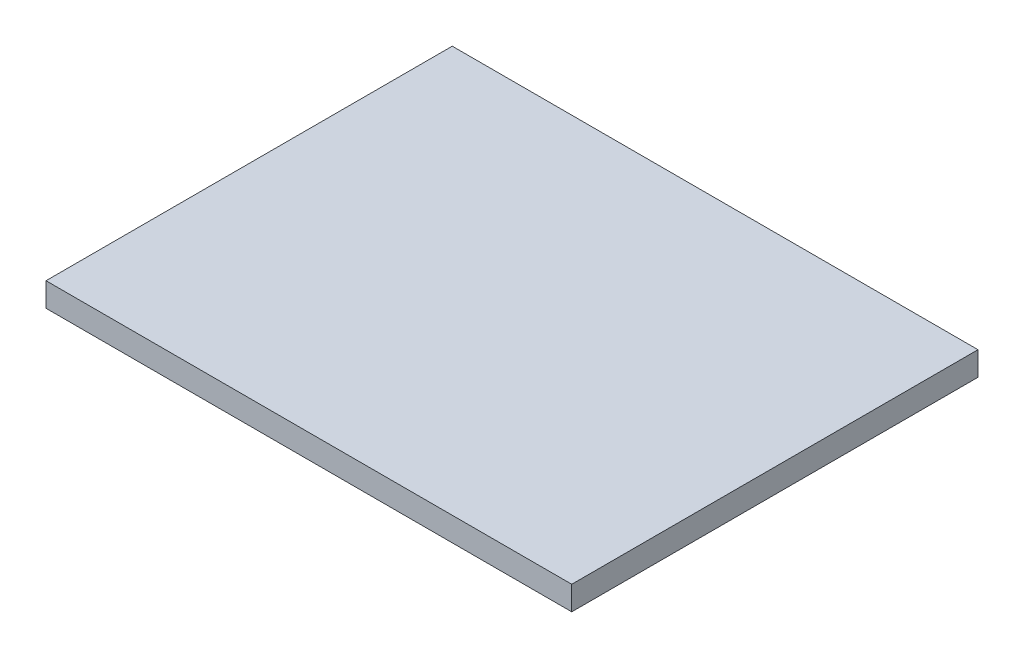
ISO-10303-21;
HEADER;
FILE_DESCRIPTION(('STEP AP214'),'2;1');
FILE_NAME('part.step','',(''),(''),'','','');
FILE_SCHEMA(('AUTOMOTIVE_DESIGN { 1 0 10303 214 1 1 1 1 }'));
ENDSEC;
DATA;
#1=APPLICATION_CONTEXT('core data for automotive mechanical design processes');
#2=APPLICATION_PROTOCOL_DEFINITION('international standard','automotive_design',2000,#1);
#3=PRODUCT_CONTEXT('',#1,'mechanical');
#4=PRODUCT('Part','Part','',(#3));
#5=PRODUCT_RELATED_PRODUCT_CATEGORY('part','',(#4));
#6=PRODUCT_DEFINITION_FORMATION('','',#4);
#7=PRODUCT_DEFINITION_CONTEXT('part definition',#1,'design');
#8=PRODUCT_DEFINITION('design','',#6,#7);
#9=PRODUCT_DEFINITION_SHAPE('','',#8);
#10=(LENGTH_UNIT() NAMED_UNIT(*) SI_UNIT(.MILLI.,.METRE.));
#11=(NAMED_UNIT(*) PLANE_ANGLE_UNIT() SI_UNIT($,.RADIAN.));
#12=(NAMED_UNIT(*) SI_UNIT($,.STERADIAN.) SOLID_ANGLE_UNIT());
#13=UNCERTAINTY_MEASURE_WITH_UNIT(LENGTH_MEASURE(1.E-05),#10,'distance_accuracy_value','');
#14=(GEOMETRIC_REPRESENTATION_CONTEXT(3) GLOBAL_UNCERTAINTY_ASSIGNED_CONTEXT((#13)) GLOBAL_UNIT_ASSIGNED_CONTEXT((#10,
#11,#12)) REPRESENTATION_CONTEXT('',''));
#15=CARTESIAN_POINT('',(0.,0.,0.));
#16=DIRECTION('',(0.,0.,1.));
#17=DIRECTION('',(1.,0.,0.));
#18=AXIS2_PLACEMENT_3D('',#15,#16,#17);
#19=CARTESIAN_POINT('',(0.,5.,0.));
#20=DIRECTION('',(1.,0.,0.));
#21=DIRECTION('',(0.,0.,-1.));
#22=AXIS2_PLACEMENT_3D('',#19,#20,#21);
#23=PLANE('',#22);
#24=DIRECTION('',(0.,0.,1.));
#25=VECTOR('',#24,1.);
#26=CARTESIAN_POINT('',(0.,0.,0.));
#27=LINE('',#26,#25);
#28=CARTESIAN_POINT('',(0.,0.,-85.));
#29=VERTEX_POINT('',#28);
#30=CARTESIAN_POINT('',(0.,0.,0.));
#31=VERTEX_POINT('',#30);
#32=EDGE_CURVE('E94',#29,#31,#27,.T.);
#33=ORIENTED_EDGE('',*,*,#32,.T.);
#34=DIRECTION('',(0.,-1.,0.));
#35=VECTOR('',#34,1.);
#36=CARTESIAN_POINT('',(0.,5.,0.));
#37=LINE('',#36,#35);
#38=CARTESIAN_POINT('',(0.,5.,0.));
#39=VERTEX_POINT('',#38);
#40=EDGE_CURVE('E11',#39,#31,#37,.T.);
#41=ORIENTED_EDGE('',*,*,#40,.F.);
#42=DIRECTION('',(0.,0.,1.));
#43=VECTOR('',#42,1.);
#44=CARTESIAN_POINT('',(0.,5.,0.));
#45=LINE('',#44,#43);
#46=CARTESIAN_POINT('',(0.,5.,-85.));
#47=VERTEX_POINT('',#46);
#48=EDGE_CURVE('E82',#47,#39,#45,.T.);
#49=ORIENTED_EDGE('',*,*,#48,.F.);
#50=DIRECTION('',(0.,-1.,0.));
#51=VECTOR('',#50,1.);
#52=CARTESIAN_POINT('',(0.,5.,-85.));
#53=LINE('',#52,#51);
#54=EDGE_CURVE('E90',#47,#29,#53,.T.);
#55=ORIENTED_EDGE('',*,*,#54,.T.);
#56=EDGE_LOOP('',(#33,#41,#49,#55));
#57=FACE_BOUND('',#56,.T.);
#58=ADVANCED_FACE('F31',(#57),#23,.F.);
#59=CARTESIAN_POINT('',(0.,5.,0.));
#60=DIRECTION('',(0.,0.,-1.));
#61=DIRECTION('',(-1.,0.,0.));
#62=AXIS2_PLACEMENT_3D('',#59,#60,#61);
#63=PLANE('',#62);
#64=DIRECTION('',(1.,0.,0.));
#65=VECTOR('',#64,1.);
#66=CARTESIAN_POINT('',(0.,0.,0.));
#67=LINE('',#66,#65);
#68=CARTESIAN_POINT('',(110.,0.,0.));
#69=VERTEX_POINT('',#68);
#70=EDGE_CURVE('E86',#31,#69,#67,.T.);
#71=ORIENTED_EDGE('',*,*,#70,.T.);
#72=DIRECTION('',(0.,-1.,0.));
#73=VECTOR('',#72,1.);
#74=CARTESIAN_POINT('',(110.,5.,0.));
#75=LINE('',#74,#73);
#76=CARTESIAN_POINT('',(110.,5.,0.));
#77=VERTEX_POINT('',#76);
#78=EDGE_CURVE('E39',#77,#69,#75,.T.);
#79=ORIENTED_EDGE('',*,*,#78,.F.);
#80=DIRECTION('',(1.,0.,0.));
#81=VECTOR('',#80,1.);
#82=CARTESIAN_POINT('',(0.,5.,0.));
#83=LINE('',#82,#81);
#84=EDGE_CURVE('E77',#39,#77,#83,.T.);
#85=ORIENTED_EDGE('',*,*,#84,.F.);
#86=ORIENTED_EDGE('',*,*,#40,.T.);
#87=EDGE_LOOP('',(#71,#79,#85,#86));
#88=FACE_BOUND('',#87,.T.);
#89=ADVANCED_FACE('F85',(#88),#63,.F.);
#90=CARTESIAN_POINT('',(110.,5.,0.));
#91=DIRECTION('',(-1.,0.,0.));
#92=DIRECTION('',(0.,0.,1.));
#93=AXIS2_PLACEMENT_3D('',#90,#91,#92);
#94=PLANE('',#93);
#95=DIRECTION('',(0.,0.,-1.));
#96=VECTOR('',#95,1.);
#97=CARTESIAN_POINT('',(110.,0.,0.));
#98=LINE('',#97,#96);
#99=CARTESIAN_POINT('',(110.,0.,-85.));
#100=VERTEX_POINT('',#99);
#101=EDGE_CURVE('E64',#69,#100,#98,.T.);
#102=ORIENTED_EDGE('',*,*,#101,.T.);
#103=DIRECTION('',(0.,-1.,0.));
#104=VECTOR('',#103,1.);
#105=CARTESIAN_POINT('',(110.,5.,-85.));
#106=LINE('',#105,#104);
#107=CARTESIAN_POINT('',(110.,5.,-85.));
#108=VERTEX_POINT('',#107);
#109=EDGE_CURVE('E87',#108,#100,#106,.T.);
#110=ORIENTED_EDGE('',*,*,#109,.F.);
#111=DIRECTION('',(0.,0.,-1.));
#112=VECTOR('',#111,1.);
#113=CARTESIAN_POINT('',(110.,5.,0.));
#114=LINE('',#113,#112);
#115=EDGE_CURVE('E80',#77,#108,#114,.T.);
#116=ORIENTED_EDGE('',*,*,#115,.F.);
#117=ORIENTED_EDGE('',*,*,#78,.T.);
#118=EDGE_LOOP('',(#102,#110,#116,#117));
#119=FACE_BOUND('',#118,.T.);
#120=ADVANCED_FACE('F88',(#119),#94,.F.);
#121=CARTESIAN_POINT('',(0.,5.,-85.));
#122=DIRECTION('',(0.,0.,1.));
#123=DIRECTION('',(1.,0.,0.));
#124=AXIS2_PLACEMENT_3D('',#121,#122,#123);
#125=PLANE('',#124);
#126=DIRECTION('',(-1.,0.,0.));
#127=VECTOR('',#126,1.);
#128=CARTESIAN_POINT('',(0.,0.,-85.));
#129=LINE('',#128,#127);
#130=EDGE_CURVE('E70',#100,#29,#129,.T.);
#131=ORIENTED_EDGE('',*,*,#130,.T.);
#132=ORIENTED_EDGE('',*,*,#54,.F.);
#133=DIRECTION('',(-1.,0.,0.));
#134=VECTOR('',#133,1.);
#135=CARTESIAN_POINT('',(0.,5.,-85.));
#136=LINE('',#135,#134);
#137=EDGE_CURVE('E47',#108,#47,#136,.T.);
#138=ORIENTED_EDGE('',*,*,#137,.F.);
#139=ORIENTED_EDGE('',*,*,#109,.T.);
#140=EDGE_LOOP('',(#131,#132,#138,#139));
#141=FACE_BOUND('',#140,.T.);
#142=ADVANCED_FACE('F101',(#141),#125,.F.);
#143=CARTESIAN_POINT('',(0.,5.,-85.));
#144=DIRECTION('',(0.,-1.,0.));
#145=DIRECTION('',(0.,0.,-1.));
#146=AXIS2_PLACEMENT_3D('',#143,#144,#145);
#147=PLANE('',#146);
#148=ORIENTED_EDGE('',*,*,#48,.T.);
#149=ORIENTED_EDGE('',*,*,#84,.T.);
#150=ORIENTED_EDGE('',*,*,#115,.T.);
#151=ORIENTED_EDGE('',*,*,#137,.T.);
#152=EDGE_LOOP('',(#148,#149,#150,#151));
#153=FACE_BOUND('',#152,.T.);
#154=ADVANCED_FACE('F78',(#153),#147,.F.);
#155=CARTESIAN_POINT('',(0.,0.,-85.));
#156=DIRECTION('',(0.,-1.,0.));
#157=DIRECTION('',(0.,0.,-1.));
#158=AXIS2_PLACEMENT_3D('',#155,#156,#157);
#159=PLANE('',#158);
#160=ORIENTED_EDGE('',*,*,#32,.F.);
#161=ORIENTED_EDGE('',*,*,#130,.F.);
#162=ORIENTED_EDGE('',*,*,#101,.F.);
#163=ORIENTED_EDGE('',*,*,#70,.F.);
#164=EDGE_LOOP('',(#160,#161,#162,#163));
#165=FACE_BOUND('',#164,.T.);
#166=ADVANCED_FACE('F104',(#165),#159,.T.);
#167=CLOSED_SHELL('',(#58,#89,#120,#142,#154,#166));
#168=MANIFOLD_SOLID_BREP('B2',#167);
#169=ADVANCED_BREP_SHAPE_REPRESENTATION('',(#18,#168),#14);
#170=SHAPE_DEFINITION_REPRESENTATION(#9,#169);
ENDSEC;
END-ISO-10303-21;
